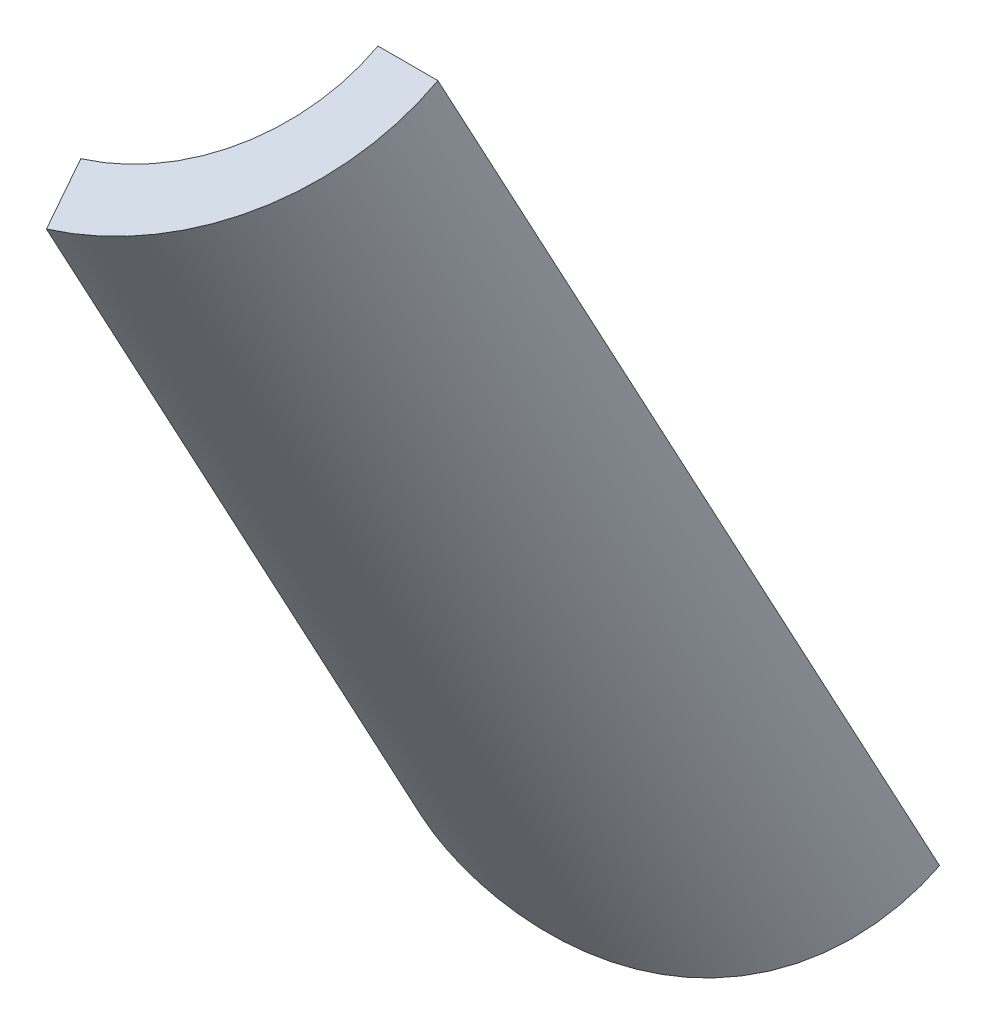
ISO-10303-21;
HEADER;
FILE_DESCRIPTION(('STEP AP214'),'2;1');
FILE_NAME('part.step','',(''),(''),'','','');
FILE_SCHEMA(('AUTOMOTIVE_DESIGN { 1 0 10303 214 1 1 1 1 }'));
ENDSEC;
DATA;
#1=APPLICATION_CONTEXT('core data for automotive mechanical design processes');
#2=APPLICATION_PROTOCOL_DEFINITION('international standard','automotive_design',2000,#1);
#3=PRODUCT_CONTEXT('',#1,'mechanical');
#4=PRODUCT('Part','Part','',(#3));
#5=PRODUCT_RELATED_PRODUCT_CATEGORY('part','',(#4));
#6=PRODUCT_DEFINITION_FORMATION('','',#4);
#7=PRODUCT_DEFINITION_CONTEXT('part definition',#1,'design');
#8=PRODUCT_DEFINITION('design','',#6,#7);
#9=PRODUCT_DEFINITION_SHAPE('','',#8);
#10=(LENGTH_UNIT() NAMED_UNIT(*) SI_UNIT(.MILLI.,.METRE.));
#11=(NAMED_UNIT(*) PLANE_ANGLE_UNIT() SI_UNIT($,.RADIAN.));
#12=(NAMED_UNIT(*) SI_UNIT($,.STERADIAN.) SOLID_ANGLE_UNIT());
#13=UNCERTAINTY_MEASURE_WITH_UNIT(LENGTH_MEASURE(1.E-05),#10,'distance_accuracy_value','');
#14=(GEOMETRIC_REPRESENTATION_CONTEXT(3) GLOBAL_UNCERTAINTY_ASSIGNED_CONTEXT((#13)) GLOBAL_UNIT_ASSIGNED_CONTEXT((#10,
#11,#12)) REPRESENTATION_CONTEXT('',''));
#15=CARTESIAN_POINT('',(0.,0.,0.));
#16=DIRECTION('',(0.,0.,1.));
#17=DIRECTION('',(1.,0.,0.));
#18=AXIS2_PLACEMENT_3D('',#15,#16,#17);
#19=CARTESIAN_POINT('',(-6.80348171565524,15.9690588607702,98.3008468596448));
#20=DIRECTION('',(0.,0.880275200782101,0.474463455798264));
#21=DIRECTION('',(0.,-0.474463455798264,0.880275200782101));
#22=AXIS2_PLACEMENT_3D('',#19,#20,#21);
#23=CYLINDRICAL_SURFACE('',#22,6.305658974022);
#24=CARTESIAN_POINT('',(-5.07724209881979,21.0140240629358,107.909684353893));
#25=CARTESIAN_POINT('',(-5.07724635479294,20.8962565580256,107.846199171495));
#26=CARTESIAN_POINT('',(-5.07437286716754,20.7788702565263,107.782009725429));
#27=CARTESIAN_POINT('',(-5.06290215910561,20.5451196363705,107.652295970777));
#28=CARTESIAN_POINT('',(-5.05430495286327,20.4287553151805,107.586771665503));
#29=CARTESIAN_POINT('',(-5.03141674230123,20.1972892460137,107.45445102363));
#30=CARTESIAN_POINT('',(-5.01712483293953,20.0821877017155,107.387654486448));
#31=CARTESIAN_POINT('',(-4.98291579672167,19.8535656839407,107.252828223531));
#32=CARTESIAN_POINT('',(-4.96299867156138,19.7400452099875,107.184798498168));
#33=CARTESIAN_POINT('',(-4.89464059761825,19.4008764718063,106.977978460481));
#34=CARTESIAN_POINT('',(-4.83773367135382,19.1780374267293,106.837262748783));
#35=CARTESIAN_POINT('',(-4.70247847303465,18.7427448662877,106.55029522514));
#36=CARTESIAN_POINT('',(-4.6241328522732,18.5302900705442,106.404044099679));
#37=CARTESIAN_POINT('',(-4.45266562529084,18.1309215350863,106.113710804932));
#38=CARTESIAN_POINT('',(-4.36068828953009,17.9432404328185,105.970009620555));
#39=CARTESIAN_POINT('',(-4.16063619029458,17.582563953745,105.675456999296));
#40=CARTESIAN_POINT('',(-4.05255999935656,17.4095698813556,105.524604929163));
#41=CARTESIAN_POINT('',(-3.82292044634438,17.0820755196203,105.214974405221));
#42=CARTESIAN_POINT('',(-3.7014138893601,16.9275026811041,105.056230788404));
#43=CARTESIAN_POINT('',(-3.44735221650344,16.639379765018,104.728852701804));
#44=CARTESIAN_POINT('',(-3.31480282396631,16.5058188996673,104.560223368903));
#45=CARTESIAN_POINT('',(-3.0853324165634,16.3013469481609,104.266868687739));
#46=CARTESIAN_POINT('',(-2.99037272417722,16.2239681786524,104.145087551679));
#47=CARTESIAN_POINT('',(-2.79841312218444,16.0815756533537,103.896047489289));
#48=CARTESIAN_POINT('',(-2.70141377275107,16.0165585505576,103.76879005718));
#49=CARTESIAN_POINT('',(-2.50702521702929,15.8997641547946,103.508702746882));
#50=CARTESIAN_POINT('',(-2.4096362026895,15.8479810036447,103.375875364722));
#51=CARTESIAN_POINT('',(-2.21622830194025,15.7582593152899,103.104635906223));
#52=CARTESIAN_POINT('',(-2.12020945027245,15.7203211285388,102.966223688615));
#53=CARTESIAN_POINT('',(-1.93094948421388,15.6584702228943,102.683278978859));
#54=CARTESIAN_POINT('',(-1.83772688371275,15.6346370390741,102.538716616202));
#55=CARTESIAN_POINT('',(-1.65662792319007,15.6013182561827,102.244659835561));
#56=CARTESIAN_POINT('',(-1.56875162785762,15.5918328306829,102.095165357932));
#57=CARTESIAN_POINT('',(-1.40026541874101,15.5868061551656,101.791853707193));
#58=CARTESIAN_POINT('',(-1.31965740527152,15.5912685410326,101.638035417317));
#59=CARTESIAN_POINT('',(-1.16751609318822,15.6133696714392,101.326909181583));
#60=CARTESIAN_POINT('',(-1.09598199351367,15.6310072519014,101.169601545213));
#61=CARTESIAN_POINT('',(-0.969594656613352,15.6761948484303,100.866929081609));
#62=CARTESIAN_POINT('',(-0.913813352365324,15.7026877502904,100.721791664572));
#63=CARTESIAN_POINT('',(-0.811940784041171,15.7646733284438,100.430046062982));
#64=CARTESIAN_POINT('',(-0.765849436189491,15.8001659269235,100.283437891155));
#65=CARTESIAN_POINT('',(-0.684139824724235,15.8790662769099,99.989567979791));
#66=CARTESIAN_POINT('',(-0.648513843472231,15.9224681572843,99.8423068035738));
#67=CARTESIAN_POINT('',(-0.58825795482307,16.0161126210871,99.5477675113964));
#68=CARTESIAN_POINT('',(-0.563624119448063,16.0663527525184,99.400489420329));
#69=CARTESIAN_POINT('',(-0.529114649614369,16.1631222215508,99.1328538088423));
#70=CARTESIAN_POINT('',(-0.517388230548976,16.2087099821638,99.0123893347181));
#71=CARTESIAN_POINT('',(-0.501745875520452,16.3031476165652,98.7725304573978));
#72=CARTESIAN_POINT('',(-0.497813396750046,16.3519903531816,98.6531343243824));
#73=CARTESIAN_POINT('',(-0.49782274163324,16.4022391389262,98.5343286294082));
#74=B_SPLINE_CURVE_WITH_KNOTS('',3,(#24,#25,#26,#27,#28,#29,#30,#31,#32,#33,#34,#35,#36,#37,#38,
#39,#40,#41,#42,#43,#44,#45,#46,#47,#48,#49,#50,#51,#52,#53,#54,#55,#56,#57,#58,#59,#60,#61,#62,
#63,#64,#65,#66,#67,#68,#69,#70,#71,#72,#73),.UNSPECIFIED.,.F.,.F.,(4,2,2,2,2,2,2,2,2,2,2,2,2,2,
2,2,2,2,2,2,2,2,2,2,4),(0.,0.401331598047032,0.802662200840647,1.20405661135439,
1.60545090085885,2.41312864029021,3.22070654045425,3.98064520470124,4.74065129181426,
5.49755769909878,6.25407422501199,6.77178258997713,7.28935058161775,7.8066890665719,
8.32404064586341,8.84428233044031,9.36453030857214,9.88491391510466,10.4052515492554,
10.8778808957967,11.3505061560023,11.8227820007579,12.2948889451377,12.6826190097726,
13.0695252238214),.UNSPECIFIED.);
#75=CARTESIAN_POINT('',(-5.07724209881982,21.0140240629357,107.909684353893));
#76=VERTEX_POINT('',#75);
#77=CARTESIAN_POINT('',(-0.497822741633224,16.4022391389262,98.5343286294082));
#78=VERTEX_POINT('',#77);
#79=EDGE_CURVE('E21',#76,#78,#74,.T.);
#80=ORIENTED_EDGE('',*,*,#79,.F.);
#81=DIRECTION('',(0.,0.880275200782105,0.474463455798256));
#82=VECTOR('',#81,1.);
#83=CARTESIAN_POINT('',(-5.07724209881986,21.0140240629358,107.909684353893));
#84=LINE('',#83,#82);
#85=CARTESIAN_POINT('',(-5.07724209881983,44.2065815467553,120.410344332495));
#86=VERTEX_POINT('',#85);
#87=EDGE_CURVE('E59',#76,#86,#84,.T.);
#88=ORIENTED_EDGE('',*,*,#87,.T.);
#89=CARTESIAN_POINT('',(-6.80348171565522,47.0840931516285,115.071677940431));
#90=DIRECTION('',(0.,0.880275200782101,0.474463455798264));
#91=DIRECTION('',(0.,-0.474463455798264,0.880275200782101));
#92=AXIS2_PLACEMENT_3D('',#89,#90,#91);
#93=CIRCLE('',#92,6.305658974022);
#94=CARTESIAN_POINT('',(-0.497822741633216,47.0840931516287,115.071677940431));
#95=VERTEX_POINT('',#94);
#96=EDGE_CURVE('E74',#95,#86,#93,.F.);
#97=ORIENTED_EDGE('',*,*,#96,.F.);
#98=DIRECTION('',(0.,0.880275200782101,0.474463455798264));
#99=VECTOR('',#98,1.);
#100=CARTESIAN_POINT('',(-0.497822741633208,-37.4612919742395,69.5021838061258));
#101=LINE('',#100,#99);
#102=EDGE_CURVE('E72',#78,#95,#101,.T.);
#103=ORIENTED_EDGE('',*,*,#102,.F.);
#104=EDGE_LOOP('',(#80,#88,#97,#103));
#105=FACE_BOUND('',#104,.T.);
#106=ADVANCED_FACE('F17',(#105),#23,.F.);
#107=CARTESIAN_POINT('',(-4.94095795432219,-40.5659789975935,75.2623302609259));
#108=DIRECTION('',(0.96179792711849,0.129889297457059,-0.240984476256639));
#109=DIRECTION('',(-0.243043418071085,0.,-0.970015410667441));
#110=AXIS2_PLACEMENT_3D('',#107,#108,#109);
#111=PLANE('',#110);
#112=DIRECTION('',(0.273760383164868,-0.456337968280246,0.846646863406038));
#113=VECTOR('',#112,1.);
#114=CARTESIAN_POINT('',(-4.52972133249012,20.1013481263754,109.602978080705));
#115=LINE('',#114,#113);
#116=CARTESIAN_POINT('',(-4.52972133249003,20.1013481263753,109.602978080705));
#117=VERTEX_POINT('',#116);
#118=EDGE_CURVE('E69',#117,#76,#115,.F.);
#119=ORIENTED_EDGE('',*,*,#118,.F.);
#120=DIRECTION('',(0.,0.880275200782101,0.474463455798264));
#121=VECTOR('',#120,1.);
#122=CARTESIAN_POINT('',(-4.52972133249,12.1788713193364,105.332806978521));
#123=LINE('',#122,#121);
#124=CARTESIAN_POINT('',(-4.52972133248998,43.2939056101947,122.103638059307));
#125=VERTEX_POINT('',#124);
#126=EDGE_CURVE('E87',#125,#117,#123,.F.);
#127=ORIENTED_EDGE('',*,*,#126,.F.);
#128=DIRECTION('',(0.27376038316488,-0.456337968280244,0.846646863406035));
#129=VECTOR('',#128,1.);
#130=CARTESIAN_POINT('',(-5.07724209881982,44.2065815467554,120.410344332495));
#131=LINE('',#130,#129);
#132=EDGE_CURVE('E81',#86,#125,#131,.T.);
#133=ORIENTED_EDGE('',*,*,#132,.F.);
#134=ORIENTED_EDGE('',*,*,#87,.F.);
#135=EDGE_LOOP('',(#119,#127,#133,#134));
#136=FACE_BOUND('',#135,.T.);
#137=ADVANCED_FACE('F95',(#136),#111,.F.);
#138=CARTESIAN_POINT('',(4.12646001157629,21.2703518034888,107.434117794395));
#139=DIRECTION('',(0.273760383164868,-0.456337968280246,0.846646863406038));
#140=DIRECTION('',(0.,-0.880275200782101,-0.474463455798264));
#141=AXIS2_PLACEMENT_3D('',#138,#139,#140);
#142=CYLINDRICAL_SURFACE('',#141,9.);
#143=ORIENTED_EDGE('',*,*,#79,.T.);
#144=CARTESIAN_POINT('',(2.5539932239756,23.891535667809,102.571017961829));
#145=DIRECTION('',(0.,0.474463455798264,-0.880275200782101));
#146=DIRECTION('',(1.,0.,0.));
#147=AXIS2_PLACEMENT_3D('',#144,#145,#146);
#148=ELLIPSE('',#147,9.35747493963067,9.);
#149=CARTESIAN_POINT('',(1.50217725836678,16.019266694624,98.3279086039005));
#150=VERTEX_POINT('',#149);
#151=EDGE_CURVE('E68',#150,#78,#148,.T.);
#152=ORIENTED_EDGE('',*,*,#151,.F.);
#153=CARTESIAN_POINT('',(-4.52972133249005,20.1013481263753,109.602978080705));
#154=CARTESIAN_POINT('',(-4.52972230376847,19.990993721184,109.543493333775));
#155=CARTESIAN_POINT('',(-4.52720145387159,19.880988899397,109.48339148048));
#156=CARTESIAN_POINT('',(-4.51713184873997,19.6618622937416,109.362017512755));
#157=CARTESIAN_POINT('',(-4.50958322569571,19.5527404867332,109.300745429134));
#158=CARTESIAN_POINT('',(-4.47942297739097,19.227008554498,109.115288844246));
#159=CARTESIAN_POINT('',(-4.44929696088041,19.0119892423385,108.989441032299));
#160=CARTESIAN_POINT('',(-4.36930086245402,18.5875640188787,108.733320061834));
#161=CARTESIAN_POINT('',(-4.3193768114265,18.3781751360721,108.603035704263));
#162=CARTESIAN_POINT('',(-4.20046079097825,17.9676102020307,108.338284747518));
#163=CARTESIAN_POINT('',(-4.13146930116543,17.7664339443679,108.203818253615));
#164=CARTESIAN_POINT('',(-3.97524277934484,17.3741789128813,107.930118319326));
#165=CARTESIAN_POINT('',(-3.88798035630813,17.1831158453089,107.790877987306));
#166=CARTESIAN_POINT('',(-3.69651479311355,16.813769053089,107.507186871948));
#167=CARTESIAN_POINT('',(-3.59231255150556,16.6354846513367,107.362736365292));
#168=CARTESIAN_POINT('',(-3.36873810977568,16.2944893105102,107.068062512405));
#169=CARTESIAN_POINT('',(-3.2493933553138,16.1317511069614,106.917849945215));
#170=CARTESIAN_POINT('',(-2.99736709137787,15.824110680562,106.610525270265));
#171=CARTESIAN_POINT('',(-2.86468888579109,15.6792040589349,106.453414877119));
#172=CARTESIAN_POINT('',(-2.61599249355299,15.4366698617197,106.163515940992));
#173=CARTESIAN_POINT('',(-2.5019203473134,15.3353742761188,106.032116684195));
#174=CARTESIAN_POINT('',(-2.26834084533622,15.1471735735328,105.763974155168));
#175=CARTESIAN_POINT('',(-2.14883463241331,15.0602654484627,105.627232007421));
#176=CARTESIAN_POINT('',(-1.90619048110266,14.9020188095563,105.348197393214));
#177=CARTESIAN_POINT('',(-1.78305436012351,14.8306726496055,105.205907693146));
#178=CARTESIAN_POINT('',(-1.53507524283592,14.7044238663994,104.915608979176));
#179=CARTESIAN_POINT('',(-1.41023222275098,14.6495214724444,104.767599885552));
#180=CARTESIAN_POINT('',(-1.16045138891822,14.5565646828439,104.465279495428));
#181=CARTESIAN_POINT('',(-1.03551559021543,14.5185857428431,104.310943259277));
#182=CARTESIAN_POINT('',(-0.788387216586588,14.4600307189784,103.996859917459));
#183=CARTESIAN_POINT('',(-0.666194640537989,14.4394546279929,103.837112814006));
#184=CARTESIAN_POINT('',(-0.426861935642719,14.4154391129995,103.512716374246));
#185=CARTESIAN_POINT('',(-0.309719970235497,14.4119934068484,103.34806885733));
#186=CARTESIAN_POINT('',(-0.0825696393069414,14.4214859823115,103.014395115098));
#187=CARTESIAN_POINT('',(0.0274389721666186,14.4344236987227,102.845369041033));
#188=CARTESIAN_POINT('',(0.230978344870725,14.4740779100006,102.515668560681));
#189=CARTESIAN_POINT('',(0.325124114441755,14.4997572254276,102.355246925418));
#190=CARTESIAN_POINT('',(0.504329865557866,14.5630994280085,102.031737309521));
#191=CARTESIAN_POINT('',(0.589390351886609,14.6007616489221,101.868649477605));
#192=CARTESIAN_POINT('',(0.749496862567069,14.686811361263,101.540079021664));
#193=CARTESIAN_POINT('',(0.824527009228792,14.7352155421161,101.37459304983));
#194=CARTESIAN_POINT('',(0.963589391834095,14.8413022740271,101.041975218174));
#195=CARTESIAN_POINT('',(1.02762025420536,14.8989859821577,100.874843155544));
#196=CARTESIAN_POINT('',(1.15428880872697,15.0330417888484,100.5098979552));
#197=CARTESIAN_POINT('',(1.2146992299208,15.1109163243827,100.311860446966));
#198=CARTESIAN_POINT('',(1.31870540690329,15.2752579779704,99.9148938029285));
#199=CARTESIAN_POINT('',(1.36229635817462,15.3617275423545,99.7159644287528));
#200=CARTESIAN_POINT('',(1.43210775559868,15.5409246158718,99.318370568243));
#201=CARTESIAN_POINT('',(1.45836208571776,15.6336395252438,99.1197063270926));
#202=CARTESIAN_POINT('',(1.49340697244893,15.8235515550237,98.7231027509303));
#203=CARTESIAN_POINT('',(1.50220643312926,15.9207463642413,98.5251630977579));
#204=CARTESIAN_POINT('',(1.50217725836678,16.0192666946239,98.3279086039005));
#205=B_SPLINE_CURVE_WITH_KNOTS('',3,(#153,#154,#155,#156,#157,#158,#159,#160,#161,#162,#163,
#164,#165,#166,#167,#168,#169,#170,#171,#172,#173,#174,#175,#176,#177,#178,#179,#180,#181,#182,
#183,#184,#185,#186,#187,#188,#189,#190,#191,#192,#193,#194,#195,#196,#197,#198,#199,#200,#201,
#202,#203,#204),.UNSPECIFIED.,.F.,.F.,(4,2,2,2,2,2,2,2,2,2,2,2,2,2,2,2,2,2,2,2,2,2,2,2,2,4),(0.,
0.3760395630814,0.7520692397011,1.50398364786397,2.25796200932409,3.01192140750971,
3.76701930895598,4.52207717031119,5.27578553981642,6.02930760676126,6.63272890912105,
7.23602389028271,7.8390217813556,8.44202808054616,9.04769670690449,9.65336508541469,
10.2588113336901,10.8642366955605,11.4269224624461,11.9895769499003,12.5531118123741,
13.1167169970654,13.7794849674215,14.4424421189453,15.1040996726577,15.765419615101),.UNSPECIFIED.);
#206=EDGE_CURVE('E82',#117,#150,#205,.T.);
#207=ORIENTED_EDGE('',*,*,#206,.F.);
#208=ORIENTED_EDGE('',*,*,#118,.T.);
#209=EDGE_LOOP('',(#143,#152,#207,#208));
#210=FACE_BOUND('',#209,.T.);
#211=ADVANCED_FACE('F65',(#210),#142,.T.);
#212=CARTESIAN_POINT('',(1.29969965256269E-13,-37.4612919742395,69.5021838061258));
#213=DIRECTION('',(0.,0.474463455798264,-0.880275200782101));
#214=DIRECTION('',(0.,0.880275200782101,0.474463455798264));
#215=AXIS2_PLACEMENT_3D('',#212,#213,#214);
#216=PLANE('',#215);
#217=ORIENTED_EDGE('',*,*,#102,.T.);
#218=DIRECTION('',(1.,0.,0.));
#219=VECTOR('',#218,1.);
#220=CARTESIAN_POINT('',(-5.07724209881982,47.0840931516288,115.071677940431));
#221=LINE('',#220,#219);
#222=CARTESIAN_POINT('',(1.5021772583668,47.0840931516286,115.071677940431));
#223=VERTEX_POINT('',#222);
#224=EDGE_CURVE('E40',#223,#95,#221,.F.);
#225=ORIENTED_EDGE('',*,*,#224,.F.);
#226=DIRECTION('',(0.,0.880275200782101,0.474463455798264));
#227=VECTOR('',#226,1.);
#228=CARTESIAN_POINT('',(1.50217725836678,15.9690588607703,98.3008468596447));
#229=LINE('',#228,#227);
#230=EDGE_CURVE('E31',#150,#223,#229,.T.);
#231=ORIENTED_EDGE('',*,*,#230,.F.);
#232=ORIENTED_EDGE('',*,*,#151,.T.);
#233=EDGE_LOOP('',(#217,#225,#231,#232));
#234=FACE_BOUND('',#233,.T.);
#235=ADVANCED_FACE('F76',(#234),#216,.T.);
#236=CARTESIAN_POINT('',(-5.07724209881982,44.2065815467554,120.410344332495));
#237=DIRECTION('',(0.,0.880275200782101,0.474463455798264));
#238=DIRECTION('',(0.,-0.474463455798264,0.880275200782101));
#239=AXIS2_PLACEMENT_3D('',#236,#237,#238);
#240=PLANE('',#239);
#241=ORIENTED_EDGE('',*,*,#96,.T.);
#242=ORIENTED_EDGE('',*,*,#132,.T.);
#243=CARTESIAN_POINT('',(-6.80348171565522,47.0840931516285,115.071677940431));
#244=DIRECTION('',(0.,0.880275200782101,0.474463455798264));
#245=DIRECTION('',(0.,-0.474463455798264,0.880275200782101));
#246=AXIS2_PLACEMENT_3D('',#243,#244,#245);
#247=CIRCLE('',#246,8.30565897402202);
#248=EDGE_CURVE('E11',#223,#125,#247,.F.);
#249=ORIENTED_EDGE('',*,*,#248,.F.);
#250=ORIENTED_EDGE('',*,*,#224,.T.);
#251=EDGE_LOOP('',(#241,#242,#249,#250));
#252=FACE_BOUND('',#251,.T.);
#253=ADVANCED_FACE('F103',(#252),#240,.T.);
#254=CARTESIAN_POINT('',(-6.80348171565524,15.9690588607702,98.3008468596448));
#255=DIRECTION('',(0.,0.880275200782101,0.474463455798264));
#256=DIRECTION('',(0.,-0.474463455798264,0.880275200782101));
#257=AXIS2_PLACEMENT_3D('',#254,#255,#256);
#258=CYLINDRICAL_SURFACE('',#257,8.30565897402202);
#259=ORIENTED_EDGE('',*,*,#230,.T.);
#260=ORIENTED_EDGE('',*,*,#248,.T.);
#261=ORIENTED_EDGE('',*,*,#126,.T.);
#262=ORIENTED_EDGE('',*,*,#206,.T.);
#263=EDGE_LOOP('',(#259,#260,#261,#262));
#264=FACE_BOUND('',#263,.T.);
#265=ADVANCED_FACE('F89',(#264),#258,.T.);
#266=CLOSED_SHELL('',(#106,#137,#211,#235,#253,#265));
#267=MANIFOLD_SOLID_BREP('B1',#266);
#268=ADVANCED_BREP_SHAPE_REPRESENTATION('',(#18,#267),#14);
#269=SHAPE_DEFINITION_REPRESENTATION(#9,#268);
ENDSEC;
END-ISO-10303-21;
